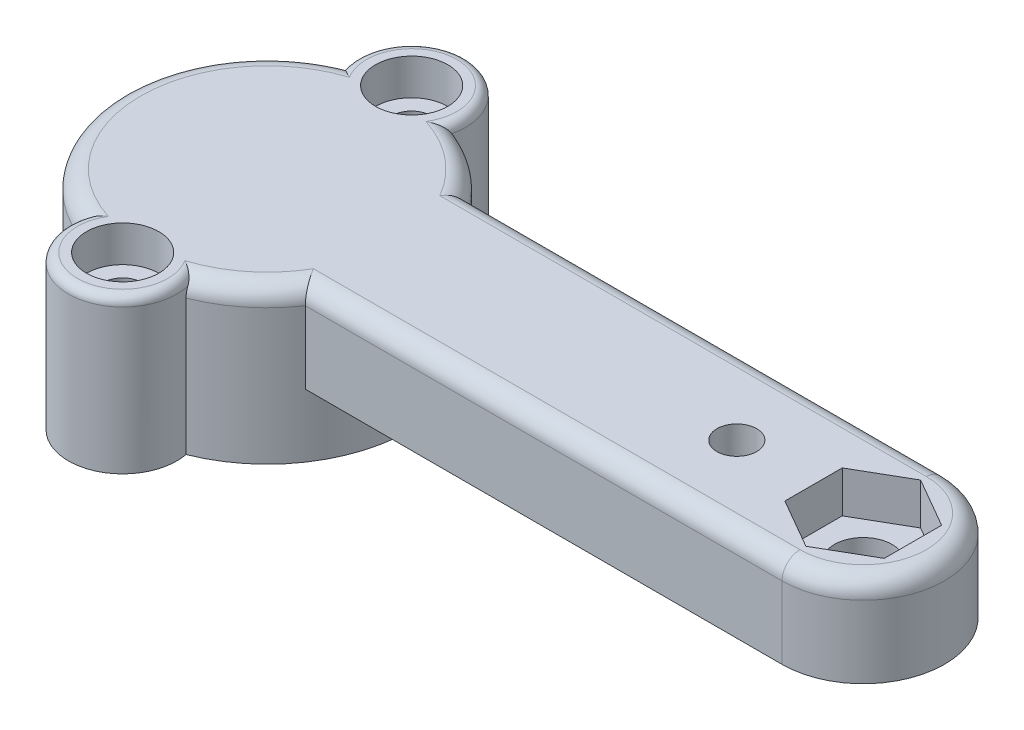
ISO-10303-21;
HEADER;
FILE_DESCRIPTION(('STEP AP214'),'2;1');
FILE_NAME('part.step','',(''),(''),'','','');
FILE_SCHEMA(('AUTOMOTIVE_DESIGN { 1 0 10303 214 1 1 1 1 }'));
ENDSEC;
DATA;
#1=APPLICATION_CONTEXT('core data for automotive mechanical design processes');
#2=APPLICATION_PROTOCOL_DEFINITION('international standard','automotive_design',2000,#1);
#3=PRODUCT_CONTEXT('',#1,'mechanical');
#4=PRODUCT('Part','Part','',(#3));
#5=PRODUCT_RELATED_PRODUCT_CATEGORY('part','',(#4));
#6=PRODUCT_DEFINITION_FORMATION('','',#4);
#7=PRODUCT_DEFINITION_CONTEXT('part definition',#1,'design');
#8=PRODUCT_DEFINITION('design','',#6,#7);
#9=PRODUCT_DEFINITION_SHAPE('','',#8);
#10=(LENGTH_UNIT() NAMED_UNIT(*) SI_UNIT(.MILLI.,.METRE.));
#11=(NAMED_UNIT(*) PLANE_ANGLE_UNIT() SI_UNIT($,.RADIAN.));
#12=(NAMED_UNIT(*) SI_UNIT($,.STERADIAN.) SOLID_ANGLE_UNIT());
#13=UNCERTAINTY_MEASURE_WITH_UNIT(LENGTH_MEASURE(1.E-05),#10,'distance_accuracy_value','');
#14=(GEOMETRIC_REPRESENTATION_CONTEXT(3) GLOBAL_UNCERTAINTY_ASSIGNED_CONTEXT((#13)) GLOBAL_UNIT_ASSIGNED_CONTEXT((#10,
#11,#12)) REPRESENTATION_CONTEXT('',''));
#15=CARTESIAN_POINT('',(0.,0.,0.));
#16=DIRECTION('',(0.,0.,1.));
#17=DIRECTION('',(1.,0.,0.));
#18=AXIS2_PLACEMENT_3D('',#15,#16,#17);
#19=CARTESIAN_POINT('',(-73.1998646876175,5.,-42.5));
#20=DIRECTION('',(0.,-1.,0.));
#21=DIRECTION('',(0.,0.,-1.));
#22=AXIS2_PLACEMENT_3D('',#19,#20,#21);
#23=CYLINDRICAL_SURFACE('',#22,1.1);
#24=CARTESIAN_POINT('',(-73.1998646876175,-3.5,-42.5));
#25=DIRECTION('',(0.,1.,0.));
#26=DIRECTION('',(0.,0.,1.));
#27=AXIS2_PLACEMENT_3D('',#24,#25,#26);
#28=CIRCLE('',#27,1.1);
#29=CARTESIAN_POINT('',(-73.1998646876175,-3.5,-41.4));
#30=VERTEX_POINT('',#29);
#31=EDGE_CURVE('E215',#30,#30,#28,.T.);
#32=ORIENTED_EDGE('',*,*,#31,.F.);
#33=EDGE_LOOP('',(#32));
#34=FACE_BOUND('',#33,.T.);
#35=CARTESIAN_POINT('',(-73.1998646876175,3.,-42.5));
#36=DIRECTION('',(0.,1.,0.));
#37=DIRECTION('',(0.,0.,1.));
#38=AXIS2_PLACEMENT_3D('',#35,#36,#37);
#39=CIRCLE('',#38,1.1);
#40=CARTESIAN_POINT('',(-73.1998646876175,3.,-41.4));
#41=VERTEX_POINT('',#40);
#42=EDGE_CURVE('E222',#41,#41,#39,.T.);
#43=ORIENTED_EDGE('',*,*,#42,.T.);
#44=EDGE_LOOP('',(#43));
#45=FACE_BOUND('',#44,.T.);
#46=ADVANCED_FACE('F37',(#34,#45),#23,.F.);
#47=CARTESIAN_POINT('',(-73.1998646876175,5.,-26.5));
#48=DIRECTION('',(0.,-1.,0.));
#49=DIRECTION('',(0.,0.,-1.));
#50=AXIS2_PLACEMENT_3D('',#47,#48,#49);
#51=CYLINDRICAL_SURFACE('',#50,1.10000000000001);
#52=CARTESIAN_POINT('',(-73.1998646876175,-3.5,-26.5));
#53=DIRECTION('',(0.,1.,0.));
#54=DIRECTION('',(0.,0.,1.));
#55=AXIS2_PLACEMENT_3D('',#52,#53,#54);
#56=CIRCLE('',#55,1.10000000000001);
#57=CARTESIAN_POINT('',(-73.1998646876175,-3.5,-25.4));
#58=VERTEX_POINT('',#57);
#59=EDGE_CURVE('E212',#58,#58,#56,.T.);
#60=ORIENTED_EDGE('',*,*,#59,.F.);
#61=EDGE_LOOP('',(#60));
#62=FACE_BOUND('',#61,.T.);
#63=CARTESIAN_POINT('',(-73.1998646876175,3.,-26.5));
#64=DIRECTION('',(0.,1.,0.));
#65=DIRECTION('',(0.,0.,1.));
#66=AXIS2_PLACEMENT_3D('',#63,#64,#65);
#67=CIRCLE('',#66,1.10000000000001);
#68=CARTESIAN_POINT('',(-73.1998646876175,3.,-25.4));
#69=VERTEX_POINT('',#68);
#70=EDGE_CURVE('E228',#69,#69,#67,.T.);
#71=ORIENTED_EDGE('',*,*,#70,.T.);
#72=EDGE_LOOP('',(#71));
#73=FACE_BOUND('',#72,.T.);
#74=ADVANCED_FACE('F400',(#62,#73),#51,.F.);
#75=CARTESIAN_POINT('',(-47.1998646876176,5.,-34.5));
#76=DIRECTION('',(0.,-1.,0.));
#77=DIRECTION('',(0.,0.,-1.));
#78=AXIS2_PLACEMENT_3D('',#75,#76,#77);
#79=CYLINDRICAL_SURFACE('',#78,1.1);
#80=CARTESIAN_POINT('',(-47.1998646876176,5.,-34.5));
#81=DIRECTION('',(0.,1.,0.));
#82=DIRECTION('',(0.,0.,1.));
#83=AXIS2_PLACEMENT_3D('',#80,#81,#82);
#84=CIRCLE('',#83,1.1);
#85=CARTESIAN_POINT('',(-47.1998646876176,5.,-33.4));
#86=VERTEX_POINT('',#85);
#87=EDGE_CURVE('E294',#86,#86,#84,.T.);
#88=ORIENTED_EDGE('',*,*,#87,.T.);
#89=EDGE_LOOP('',(#88));
#90=FACE_BOUND('',#89,.T.);
#91=CARTESIAN_POINT('',(-47.1998646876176,2.,-34.5));
#92=DIRECTION('',(0.,-1.,0.));
#93=DIRECTION('',(0.,0.,-1.));
#94=AXIS2_PLACEMENT_3D('',#91,#92,#93);
#95=CIRCLE('',#94,1.1);
#96=CARTESIAN_POINT('',(-47.1998646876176,2.,-35.6));
#97=VERTEX_POINT('',#96);
#98=EDGE_CURVE('E235',#97,#97,#95,.T.);
#99=ORIENTED_EDGE('',*,*,#98,.T.);
#100=EDGE_LOOP('',(#99));
#101=FACE_BOUND('',#100,.T.);
#102=ADVANCED_FACE('F406',(#90,#101),#79,.F.);
#103=CARTESIAN_POINT('',(-73.1998646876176,0.,-34.5));
#104=DIRECTION('',(0.,1.,0.));
#105=DIRECTION('',(0.,0.,1.));
#106=AXIS2_PLACEMENT_3D('',#103,#104,#105);
#107=PLANE('',#106);
#108=CARTESIAN_POINT('',(-47.1998646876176,0.,-34.5));
#109=DIRECTION('',(0.,-1.,0.));
#110=DIRECTION('',(0.,0.,-1.));
#111=AXIS2_PLACEMENT_3D('',#108,#109,#110);
#112=CIRCLE('',#111,2.2);
#113=CARTESIAN_POINT('',(-47.1998646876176,0.,-36.7));
#114=VERTEX_POINT('',#113);
#115=EDGE_CURVE('E236',#114,#114,#112,.T.);
#116=ORIENTED_EDGE('',*,*,#115,.F.);
#117=EDGE_LOOP('',(#116));
#118=FACE_BOUND('',#117,.T.);
#119=CARTESIAN_POINT('',(-40.1998646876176,0.,-34.5));
#120=DIRECTION('',(0.,1.,0.));
#121=DIRECTION('',(0.,0.,1.));
#122=AXIS2_PLACEMENT_3D('',#119,#120,#121);
#123=CIRCLE('',#122,1.59999999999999);
#124=CARTESIAN_POINT('',(-40.1998646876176,0.,-32.9));
#125=VERTEX_POINT('',#124);
#126=EDGE_CURVE('E297',#125,#125,#123,.T.);
#127=ORIENTED_EDGE('',*,*,#126,.T.);
#128=EDGE_LOOP('',(#127));
#129=FACE_BOUND('',#128,.T.);
#130=CARTESIAN_POINT('',(-73.1998646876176,0.,-34.5));
#131=DIRECTION('',(0.,-1.,0.));
#132=DIRECTION('',(0.,0.,-1.));
#133=AXIS2_PLACEMENT_3D('',#130,#131,#132);
#134=CIRCLE('',#133,8.00000000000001);
#135=CARTESIAN_POINT('',(-66.5854864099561,0.,-39.));
#136=VERTEX_POINT('',#135);
#137=CARTESIAN_POINT('',(-66.5854864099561,0.,-30.));
#138=VERTEX_POINT('',#137);
#139=EDGE_CURVE('E315',#136,#138,#134,.T.);
#140=ORIENTED_EDGE('',*,*,#139,.F.);
#141=DIRECTION('',(-1.,0.,0.));
#142=VECTOR('',#141,1.);
#143=CARTESIAN_POINT('',(-40.1998646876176,0.,-39.));
#144=LINE('',#143,#142);
#145=CARTESIAN_POINT('',(-40.1998646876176,0.,-39.));
#146=VERTEX_POINT('',#145);
#147=EDGE_CURVE('E304',#146,#136,#144,.T.);
#148=ORIENTED_EDGE('',*,*,#147,.F.);
#149=CARTESIAN_POINT('',(-40.1998646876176,0.,-34.5));
#150=DIRECTION('',(0.,1.,0.));
#151=DIRECTION('',(0.,0.,1.));
#152=AXIS2_PLACEMENT_3D('',#149,#150,#151);
#153=CIRCLE('',#152,4.5);
#154=CARTESIAN_POINT('',(-40.1998646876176,0.,-30.));
#155=VERTEX_POINT('',#154);
#156=EDGE_CURVE('E301',#155,#146,#153,.T.);
#157=ORIENTED_EDGE('',*,*,#156,.F.);
#158=DIRECTION('',(1.,0.,0.));
#159=VECTOR('',#158,1.);
#160=CARTESIAN_POINT('',(-40.1998646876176,0.,-30.));
#161=LINE('',#160,#159);
#162=EDGE_CURVE('E300',#138,#155,#161,.T.);
#163=ORIENTED_EDGE('',*,*,#162,.F.);
#164=EDGE_LOOP('',(#140,#148,#157,#163));
#165=FACE_BOUND('',#164,.T.);
#166=ADVANCED_FACE('F417',(#118,#129,#165),#107,.F.);
#167=CARTESIAN_POINT('',(-40.1998646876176,5.,-34.5));
#168=DIRECTION('',(0.,-1.,0.));
#169=DIRECTION('',(0.,0.,-1.));
#170=AXIS2_PLACEMENT_3D('',#167,#168,#169);
#171=CYLINDRICAL_SURFACE('',#170,1.59999999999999);
#172=ORIENTED_EDGE('',*,*,#126,.F.);
#173=EDGE_LOOP('',(#172));
#174=FACE_BOUND('',#173,.T.);
#175=CARTESIAN_POINT('',(-40.1998646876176,2.7,-34.5));
#176=DIRECTION('',(0.,1.,0.));
#177=DIRECTION('',(0.,0.,1.));
#178=AXIS2_PLACEMENT_3D('',#175,#176,#177);
#179=CIRCLE('',#178,1.59999999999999);
#180=CARTESIAN_POINT('',(-40.1998646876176,2.7,-32.9));
#181=VERTEX_POINT('',#180);
#182=EDGE_CURVE('E283',#181,#181,#179,.T.);
#183=ORIENTED_EDGE('',*,*,#182,.T.);
#184=EDGE_LOOP('',(#183));
#185=FACE_BOUND('',#184,.T.);
#186=ADVANCED_FACE('F419',(#174,#185),#171,.F.);
#187=CARTESIAN_POINT('',(-73.1998646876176,5.,-34.5));
#188=DIRECTION('',(0.,1.,0.));
#189=DIRECTION('',(0.,0.,1.));
#190=AXIS2_PLACEMENT_3D('',#187,#188,#189);
#191=PLANE('',#190);
#192=CARTESIAN_POINT('',(-73.1998646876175,5.,-42.5));
#193=DIRECTION('',(0.,1.,0.));
#194=DIRECTION('',(0.,0.,1.));
#195=AXIS2_PLACEMENT_3D('',#192,#193,#194);
#196=CIRCLE('',#195,2.);
#197=CARTESIAN_POINT('',(-73.1998646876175,5.,-40.5));
#198=VERTEX_POINT('',#197);
#199=EDGE_CURVE('E218',#198,#198,#196,.T.);
#200=ORIENTED_EDGE('',*,*,#199,.F.);
#201=EDGE_LOOP('',(#200));
#202=FACE_BOUND('',#201,.T.);
#203=CARTESIAN_POINT('',(-73.1998646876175,5.,-26.5));
#204=DIRECTION('',(0.,1.,0.));
#205=DIRECTION('',(0.,0.,1.));
#206=AXIS2_PLACEMENT_3D('',#203,#204,#205);
#207=CIRCLE('',#206,2.);
#208=CARTESIAN_POINT('',(-73.1998646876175,5.,-24.5));
#209=VERTEX_POINT('',#208);
#210=EDGE_CURVE('E229',#209,#209,#207,.T.);
#211=ORIENTED_EDGE('',*,*,#210,.F.);
#212=EDGE_LOOP('',(#211));
#213=FACE_BOUND('',#212,.T.);
#214=DIRECTION('',(0.866025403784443,0.,0.499999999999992));
#215=VECTOR('',#214,1.);
#216=CARTESIAN_POINT('',(-42.9498646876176,5.,-32.9122867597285));
#217=LINE('',#216,#215);
#218=CARTESIAN_POINT('',(-42.9498646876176,5.,-32.9122867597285));
#219=VERTEX_POINT('',#218);
#220=CARTESIAN_POINT('',(-40.1998646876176,5.,-31.324573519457));
#221=VERTEX_POINT('',#220);
#222=EDGE_CURVE('E245',#219,#221,#217,.T.);
#223=ORIENTED_EDGE('',*,*,#222,.F.);
#224=DIRECTION('',(0.,0.,1.));
#225=VECTOR('',#224,1.);
#226=CARTESIAN_POINT('',(-42.9498646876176,5.,-36.0877132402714));
#227=LINE('',#226,#225);
#228=CARTESIAN_POINT('',(-42.9498646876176,5.,-36.0877132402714));
#229=VERTEX_POINT('',#228);
#230=EDGE_CURVE('E250',#229,#219,#227,.T.);
#231=ORIENTED_EDGE('',*,*,#230,.F.);
#232=DIRECTION('',(-0.866025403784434,0.,0.500000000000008));
#233=VECTOR('',#232,1.);
#234=CARTESIAN_POINT('',(-40.1998646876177,5.,-37.6754264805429));
#235=LINE('',#234,#233);
#236=CARTESIAN_POINT('',(-40.1998646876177,5.,-37.6754264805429));
#237=VERTEX_POINT('',#236);
#238=EDGE_CURVE('E276',#237,#229,#235,.T.);
#239=ORIENTED_EDGE('',*,*,#238,.F.);
#240=DIRECTION('',(-0.866025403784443,0.,-0.499999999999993));
#241=VECTOR('',#240,1.);
#242=CARTESIAN_POINT('',(-37.4498646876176,5.,-36.0877132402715));
#243=LINE('',#242,#241);
#244=CARTESIAN_POINT('',(-37.4498646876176,5.,-36.0877132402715));
#245=VERTEX_POINT('',#244);
#246=EDGE_CURVE('E273',#245,#237,#243,.T.);
#247=ORIENTED_EDGE('',*,*,#246,.F.);
#248=DIRECTION('',(0.,0.,-1.));
#249=VECTOR('',#248,1.);
#250=CARTESIAN_POINT('',(-37.4498646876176,5.,-32.9122867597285));
#251=LINE('',#250,#249);
#252=CARTESIAN_POINT('',(-37.4498646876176,5.,-32.9122867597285));
#253=VERTEX_POINT('',#252);
#254=EDGE_CURVE('E270',#253,#245,#251,.T.);
#255=ORIENTED_EDGE('',*,*,#254,.F.);
#256=DIRECTION('',(0.866025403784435,0.,-0.500000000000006));
#257=VECTOR('',#256,1.);
#258=CARTESIAN_POINT('',(-40.1998646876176,5.,-31.324573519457));
#259=LINE('',#258,#257);
#260=EDGE_CURVE('E267',#221,#253,#259,.T.);
#261=ORIENTED_EDGE('',*,*,#260,.F.);
#262=EDGE_LOOP('',(#223,#231,#239,#247,#255,#261));
#263=FACE_BOUND('',#262,.T.);
#264=CARTESIAN_POINT('',(-73.1998646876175,5.,-26.5));
#265=DIRECTION('',(0.,1.,0.));
#266=DIRECTION('',(0.,0.,1.));
#267=AXIS2_PLACEMENT_3D('',#264,#265,#266);
#268=CIRCLE('',#267,2.50000000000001);
#269=CARTESIAN_POINT('',(-75.3179024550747,5.,-27.828125));
#270=VERTEX_POINT('',#269);
#271=CARTESIAN_POINT('',(-71.0818269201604,5.,-27.828125));
#272=VERTEX_POINT('',#271);
#273=EDGE_CURVE('E535',#270,#272,#268,.T.);
#274=ORIENTED_EDGE('',*,*,#273,.T.);
#275=CARTESIAN_POINT('',(-73.1998646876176,5.,-34.5));
#276=DIRECTION('',(0.,1.,0.));
#277=DIRECTION('',(0.,0.,1.));
#278=AXIS2_PLACEMENT_3D('',#275,#276,#277);
#279=CIRCLE('',#278,7.00000000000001);
#280=CARTESIAN_POINT('',(-67.1376868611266,5.,-31.));
#281=VERTEX_POINT('',#280);
#282=EDGE_CURVE('E515',#272,#281,#279,.T.);
#283=ORIENTED_EDGE('',*,*,#282,.T.);
#284=DIRECTION('',(1.,0.,0.));
#285=VECTOR('',#284,1.);
#286=CARTESIAN_POINT('',(-40.1998646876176,5.,-31.));
#287=LINE('',#286,#285);
#288=CARTESIAN_POINT('',(-40.1998646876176,5.,-31.));
#289=VERTEX_POINT('',#288);
#290=EDGE_CURVE('E509',#281,#289,#287,.T.);
#291=ORIENTED_EDGE('',*,*,#290,.T.);
#292=CARTESIAN_POINT('',(-40.1998646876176,5.,-34.5));
#293=DIRECTION('',(0.,1.,0.));
#294=DIRECTION('',(0.,0.,1.));
#295=AXIS2_PLACEMENT_3D('',#292,#293,#294);
#296=CIRCLE('',#295,3.5);
#297=CARTESIAN_POINT('',(-40.1998646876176,5.,-38.));
#298=VERTEX_POINT('',#297);
#299=EDGE_CURVE('E495',#289,#298,#296,.T.);
#300=ORIENTED_EDGE('',*,*,#299,.T.);
#301=DIRECTION('',(-1.,0.,0.));
#302=VECTOR('',#301,1.);
#303=CARTESIAN_POINT('',(-66.5854864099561,5.,-38.));
#304=LINE('',#303,#302);
#305=CARTESIAN_POINT('',(-67.1376868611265,5.,-38.));
#306=VERTEX_POINT('',#305);
#307=EDGE_CURVE('E504',#298,#306,#304,.T.);
#308=ORIENTED_EDGE('',*,*,#307,.T.);
#309=CARTESIAN_POINT('',(-73.1998646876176,5.,-34.5));
#310=DIRECTION('',(0.,1.,0.));
#311=DIRECTION('',(0.,0.,1.));
#312=AXIS2_PLACEMENT_3D('',#309,#310,#311);
#313=CIRCLE('',#312,7.00000000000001);
#314=CARTESIAN_POINT('',(-71.0818269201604,5.,-41.171875));
#315=VERTEX_POINT('',#314);
#316=EDGE_CURVE('E507',#306,#315,#313,.T.);
#317=ORIENTED_EDGE('',*,*,#316,.T.);
#318=CARTESIAN_POINT('',(-73.1998646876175,5.,-42.5));
#319=DIRECTION('',(0.,1.,0.));
#320=DIRECTION('',(0.,0.,1.));
#321=AXIS2_PLACEMENT_3D('',#318,#319,#320);
#322=CIRCLE('',#321,2.50000000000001);
#323=CARTESIAN_POINT('',(-75.3179024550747,5.,-41.171875));
#324=VERTEX_POINT('',#323);
#325=EDGE_CURVE('E465',#315,#324,#322,.T.);
#326=ORIENTED_EDGE('',*,*,#325,.T.);
#327=CARTESIAN_POINT('',(-73.1998646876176,5.,-34.5));
#328=DIRECTION('',(0.,1.,0.));
#329=DIRECTION('',(0.,0.,1.));
#330=AXIS2_PLACEMENT_3D('',#327,#328,#329);
#331=CIRCLE('',#330,7.00000000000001);
#332=EDGE_CURVE('E322',#324,#270,#331,.T.);
#333=ORIENTED_EDGE('',*,*,#332,.T.);
#334=EDGE_LOOP('',(#274,#283,#291,#300,#308,#317,#326,#333));
#335=FACE_BOUND('',#334,.T.);
#336=ORIENTED_EDGE('',*,*,#87,.F.);
#337=EDGE_LOOP('',(#336));
#338=FACE_BOUND('',#337,.T.);
#339=ADVANCED_FACE('F422',(#202,#213,#263,#335,#338),#191,.T.);
#340=CARTESIAN_POINT('',(-73.1998646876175,5.,-42.5));
#341=DIRECTION('',(0.,-1.,0.));
#342=DIRECTION('',(0.,0.,-1.));
#343=AXIS2_PLACEMENT_3D('',#340,#341,#342);
#344=CYLINDRICAL_SURFACE('',#343,3.00000000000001);
#345=CARTESIAN_POINT('',(-76.1466584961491,4.,-41.9375));
#346=CARTESIAN_POINT('',(-76.1466563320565,4.02792464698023,-41.9375009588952));
#347=CARTESIAN_POINT('',(-76.146435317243,4.05583559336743,-41.9363294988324));
#348=CARTESIAN_POINT('',(-76.1455398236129,4.1114515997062,-41.9316635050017));
#349=CARTESIAN_POINT('',(-76.1448654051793,4.13915668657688,-41.9281692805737));
#350=CARTESIAN_POINT('',(-76.1421428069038,4.22157091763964,-41.9142575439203));
#351=CARTESIAN_POINT('',(-76.1393954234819,4.27571851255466,-41.9004107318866));
#352=CARTESIAN_POINT('',(-76.1317589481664,4.38086381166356,-41.8641263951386));
#353=CARTESIAN_POINT('',(-76.126869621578,4.43186116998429,-41.8416879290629));
#354=CARTESIAN_POINT('',(-76.1145350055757,4.52937077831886,-41.7890676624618));
#355=CARTESIAN_POINT('',(-76.1070892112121,4.57588213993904,-41.7588843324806));
#356=CARTESIAN_POINT('',(-76.0890702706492,4.66365968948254,-41.6914711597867));
#357=CARTESIAN_POINT('',(-76.078462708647,4.70486060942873,-41.6541654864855));
#358=CARTESIAN_POINT('',(-76.0536955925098,4.78024537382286,-41.5740392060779));
#359=CARTESIAN_POINT('',(-76.0395361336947,4.81442940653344,-41.5312187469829));
#360=CARTESIAN_POINT('',(-76.0074555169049,4.87457107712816,-41.4418552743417));
#361=CARTESIAN_POINT('',(-75.9895598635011,4.90058163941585,-41.3953387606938));
#362=CARTESIAN_POINT('',(-75.9498809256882,4.94387828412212,-41.2999709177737));
#363=CARTESIAN_POINT('',(-75.9281001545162,4.96116997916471,-41.2511211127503));
#364=CARTESIAN_POINT('',(-75.8883251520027,4.98257287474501,-41.1682404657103));
#365=CARTESIAN_POINT('',(-75.8712810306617,4.98911586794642,-41.1343593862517));
#366=CARTESIAN_POINT('',(-75.8356927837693,4.99783300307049,-41.066862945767));
#367=CARTESIAN_POINT('',(-75.8171500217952,5.00001107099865,-41.0332473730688));
#368=CARTESIAN_POINT('',(-75.7979408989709,5.,-41.));
#369=B_SPLINE_CURVE_WITH_KNOTS('',3,(#345,#346,#347,#348,#349,#350,#351,#352,#353,#354,#355,
#356,#357,#358,#359,#360,#361,#362,#363,#364,#365,#366,#367,#368),.UNSPECIFIED.,.F.,.F.,(4,2,2,
2,2,2,2,2,2,2,2,4),(0.,0.0837214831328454,0.167431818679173,0.334439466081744,0.501465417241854,
0.668524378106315,0.837472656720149,1.00641640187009,1.17424252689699,1.34196047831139,
1.4571579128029,1.57225168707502),.UNSPECIFIED.);
#370=CARTESIAN_POINT('',(-76.1466584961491,4.,-41.9375));
#371=VERTEX_POINT('',#370);
#372=CARTESIAN_POINT('',(-76.1181663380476,4.50000000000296,-41.8046472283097));
#373=VERTEX_POINT('',#372);
#374=EDGE_CURVE('E460',#371,#373,#369,.T.);
#375=ORIENTED_EDGE('',*,*,#374,.T.);
#376=CARTESIAN_POINT('',(-73.1998646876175,4.5,-42.5));
#377=DIRECTION('',(0.,1.,0.));
#378=DIRECTION('',(0.,0.,1.));
#379=AXIS2_PLACEMENT_3D('',#376,#377,#378);
#380=CIRCLE('',#379,3.00000000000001);
#381=CARTESIAN_POINT('',(-70.2815630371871,4.5,-41.8046472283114));
#382=VERTEX_POINT('',#381);
#383=EDGE_CURVE('E57',#373,#382,#380,.F.);
#384=ORIENTED_EDGE('',*,*,#383,.T.);
#385=CARTESIAN_POINT('',(-70.6017884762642,5.,-41.));
#386=CARTESIAN_POINT('',(-70.5882845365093,5.00000058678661,-41.0233858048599));
#387=CARTESIAN_POINT('',(-70.575105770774,4.99892761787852,-41.0469459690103));
#388=CARTESIAN_POINT('',(-70.5494662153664,4.9946254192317,-41.0942580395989));
#389=CARTESIAN_POINT('',(-70.5370054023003,4.99139625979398,-41.1180099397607));
#390=CARTESIAN_POINT('',(-70.5008676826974,4.97848483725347,-41.1891868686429));
#391=CARTESIAN_POINT('',(-70.4783590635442,4.96557870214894,-41.2366659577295));
#392=CARTESIAN_POINT('',(-70.4368790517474,4.93145107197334,-41.3301559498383));
#393=CARTESIAN_POINT('',(-70.4179096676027,4.91022487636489,-41.3761660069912));
#394=CARTESIAN_POINT('',(-70.3835687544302,4.86005050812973,-41.4652265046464));
#395=CARTESIAN_POINT('',(-70.3681976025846,4.83110152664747,-41.5082766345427));
#396=CARTESIAN_POINT('',(-70.3407329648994,4.76594284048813,-41.5904582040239));
#397=CARTESIAN_POINT('',(-70.3286758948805,4.72965952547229,-41.6295433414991));
#398=CARTESIAN_POINT('',(-70.307695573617,4.65098989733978,-41.7020125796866));
#399=CARTESIAN_POINT('',(-70.2987733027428,4.60860168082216,-41.7353948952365));
#400=CARTESIAN_POINT('',(-70.283395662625,4.51741171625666,-41.7962754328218));
#401=CARTESIAN_POINT('',(-70.2770259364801,4.46845114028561,-41.8235576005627));
#402=CARTESIAN_POINT('',(-70.2666980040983,4.36653808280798,-41.869843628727));
#403=CARTESIAN_POINT('',(-70.262738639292,4.31358753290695,-41.8888514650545));
#404=CARTESIAN_POINT('',(-70.2575039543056,4.21717494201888,-41.9146357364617));
#405=CARTESIAN_POINT('',(-70.2558289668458,4.17420020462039,-41.9231864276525));
#406=CARTESIAN_POINT('',(-70.2536191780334,4.08749068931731,-41.9346283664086));
#407=CARTESIAN_POINT('',(-70.253084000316,4.04375616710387,-41.9375214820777));
#408=CARTESIAN_POINT('',(-70.2530708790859,4.,-41.9375));
#409=B_SPLINE_CURVE_WITH_KNOTS('',3,(#385,#386,#387,#388,#389,#390,#391,#392,#393,#394,#395,
#396,#397,#398,#399,#400,#401,#402,#403,#404,#405,#406,#407,#408),.UNSPECIFIED.,.F.,.F.,(4,2,2,
2,2,2,2,2,2,2,2,4),(0.,0.0809663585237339,0.161930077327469,0.323403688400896,0.484968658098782,
0.64655055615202,0.809842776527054,0.973186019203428,1.14162505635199,1.30998306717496,
1.44115688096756,1.57228737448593),.UNSPECIFIED.);
#410=CARTESIAN_POINT('',(-70.2530708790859,4.,-41.9375));
#411=VERTEX_POINT('',#410);
#412=EDGE_CURVE('E345',#382,#411,#409,.T.);
#413=ORIENTED_EDGE('',*,*,#412,.T.);
#414=DIRECTION('',(0.,-1.,0.));
#415=VECTOR('',#414,1.);
#416=CARTESIAN_POINT('',(-70.2530708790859,5.,-41.9375));
#417=LINE('',#416,#415);
#418=CARTESIAN_POINT('',(-70.2530708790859,-3.5,-41.9375));
#419=VERTEX_POINT('',#418);
#420=EDGE_CURVE('E313',#411,#419,#417,.T.);
#421=ORIENTED_EDGE('',*,*,#420,.T.);
#422=CARTESIAN_POINT('',(-73.1998646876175,-3.5,-42.5));
#423=DIRECTION('',(0.,1.,0.));
#424=DIRECTION('',(0.,0.,1.));
#425=AXIS2_PLACEMENT_3D('',#422,#423,#424);
#426=CIRCLE('',#425,3.00000000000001);
#427=CARTESIAN_POINT('',(-76.1466584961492,-3.5,-41.9375));
#428=VERTEX_POINT('',#427);
#429=EDGE_CURVE('E202',#419,#428,#426,.T.);
#430=ORIENTED_EDGE('',*,*,#429,.T.);
#431=DIRECTION('',(0.,-1.,0.));
#432=VECTOR('',#431,1.);
#433=CARTESIAN_POINT('',(-76.1466584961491,5.,-41.9375));
#434=LINE('',#433,#432);
#435=EDGE_CURVE('E311',#371,#428,#434,.T.);
#436=ORIENTED_EDGE('',*,*,#435,.F.);
#437=EDGE_LOOP('',(#375,#384,#413,#421,#430,#436));
#438=FACE_BOUND('',#437,.T.);
#439=ADVANCED_FACE('F426',(#438),#344,.T.);
#440=CARTESIAN_POINT('',(-73.1998646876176,5.,-34.5));
#441=DIRECTION('',(0.,-1.,0.));
#442=DIRECTION('',(0.,0.,-1.));
#443=AXIS2_PLACEMENT_3D('',#440,#441,#442);
#444=CYLINDRICAL_SURFACE('',#443,8.00000000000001);
#445=DIRECTION('',(0.,-1.,0.));
#446=VECTOR('',#445,1.);
#447=CARTESIAN_POINT('',(-76.1466584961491,5.,-27.0625));
#448=LINE('',#447,#446);
#449=CARTESIAN_POINT('',(-76.1466584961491,4.,-27.0625));
#450=VERTEX_POINT('',#449);
#451=CARTESIAN_POINT('',(-76.1466584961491,-3.5,-27.0625));
#452=VERTEX_POINT('',#451);
#453=EDGE_CURVE('E191',#450,#452,#448,.T.);
#454=ORIENTED_EDGE('',*,*,#453,.F.);
#455=CARTESIAN_POINT('',(-73.1998646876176,4.,-34.5));
#456=DIRECTION('',(0.,1.,0.));
#457=DIRECTION('',(0.,0.,1.));
#458=AXIS2_PLACEMENT_3D('',#455,#456,#457);
#459=CIRCLE('',#458,8.00000000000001);
#460=EDGE_CURVE('E336',#450,#371,#459,.F.);
#461=ORIENTED_EDGE('',*,*,#460,.T.);
#462=ORIENTED_EDGE('',*,*,#435,.T.);
#463=CARTESIAN_POINT('',(-73.1998646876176,-3.5,-34.5));
#464=DIRECTION('',(0.,1.,0.));
#465=DIRECTION('',(0.,0.,1.));
#466=AXIS2_PLACEMENT_3D('',#463,#464,#465);
#467=CIRCLE('',#466,8.00000000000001);
#468=EDGE_CURVE('E207',#428,#452,#467,.T.);
#469=ORIENTED_EDGE('',*,*,#468,.T.);
#470=EDGE_LOOP('',(#454,#461,#462,#469));
#471=FACE_BOUND('',#470,.T.);
#472=ADVANCED_FACE('F446',(#471),#444,.T.);
#473=CARTESIAN_POINT('',(-73.1998646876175,5.,-26.5));
#474=DIRECTION('',(0.,-1.,0.));
#475=DIRECTION('',(0.,0.,-1.));
#476=AXIS2_PLACEMENT_3D('',#473,#474,#475);
#477=CYLINDRICAL_SURFACE('',#476,3.00000000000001);
#478=CARTESIAN_POINT('',(-70.2530708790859,4.,-27.0625));
#479=CARTESIAN_POINT('',(-70.2530730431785,4.02792464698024,-27.0624990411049));
#480=CARTESIAN_POINT('',(-70.253294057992,4.05583559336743,-27.0636705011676));
#481=CARTESIAN_POINT('',(-70.2541895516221,4.1114515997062,-27.0683364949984));
#482=CARTESIAN_POINT('',(-70.2548639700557,4.13915668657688,-27.0718307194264));
#483=CARTESIAN_POINT('',(-70.2575865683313,4.22157091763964,-27.0857424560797));
#484=CARTESIAN_POINT('',(-70.2603339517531,4.27571851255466,-27.0995892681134));
#485=CARTESIAN_POINT('',(-70.2679704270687,4.38086381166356,-27.1358736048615));
#486=CARTESIAN_POINT('',(-70.272859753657,4.43186116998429,-27.1583120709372));
#487=CARTESIAN_POINT('',(-70.2851943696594,4.52937077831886,-27.2109323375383));
#488=CARTESIAN_POINT('',(-70.292640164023,4.57588213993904,-27.2411156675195));
#489=CARTESIAN_POINT('',(-70.3106591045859,4.66365968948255,-27.3085288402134));
#490=CARTESIAN_POINT('',(-70.3212666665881,4.70486060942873,-27.3458345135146));
#491=CARTESIAN_POINT('',(-70.3460337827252,4.78024537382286,-27.4259607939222));
#492=CARTESIAN_POINT('',(-70.3601932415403,4.81442940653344,-27.4687812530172));
#493=CARTESIAN_POINT('',(-70.3922738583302,4.87457107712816,-27.5581447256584));
#494=CARTESIAN_POINT('',(-70.410169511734,4.90058163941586,-27.6046612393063));
#495=CARTESIAN_POINT('',(-70.4498484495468,4.94387828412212,-27.7000290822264));
#496=CARTESIAN_POINT('',(-70.4716292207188,4.96116997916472,-27.7488788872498));
#497=CARTESIAN_POINT('',(-70.5114042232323,4.98257287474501,-27.8317595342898));
#498=CARTESIAN_POINT('',(-70.5284483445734,4.98911586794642,-27.8656406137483));
#499=CARTESIAN_POINT('',(-70.5640365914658,4.99783300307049,-27.9331370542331));
#500=CARTESIAN_POINT('',(-70.5825793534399,5.00001107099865,-27.9667526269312));
#501=CARTESIAN_POINT('',(-70.6017884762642,5.,-28.));
#502=B_SPLINE_CURVE_WITH_KNOTS('',3,(#478,#479,#480,#481,#482,#483,#484,#485,#486,#487,#488,
#489,#490,#491,#492,#493,#494,#495,#496,#497,#498,#499,#500,#501),.UNSPECIFIED.,.F.,.F.,(4,2,2,
2,2,2,2,2,2,2,2,4),(0.,0.0837214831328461,0.167431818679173,0.334439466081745,0.501465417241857,
0.668524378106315,0.837472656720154,1.0064164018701,1.174242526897,1.3419604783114,
1.45715791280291,1.57225168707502),.UNSPECIFIED.);
#503=CARTESIAN_POINT('',(-70.2530708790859,4.,-27.0625));
#504=VERTEX_POINT('',#503);
#505=CARTESIAN_POINT('',(-70.2815630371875,4.50000000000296,-27.1953527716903));
#506=VERTEX_POINT('',#505);
#507=EDGE_CURVE('E338',#504,#506,#502,.T.);
#508=ORIENTED_EDGE('',*,*,#507,.T.);
#509=CARTESIAN_POINT('',(-73.1998646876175,4.5,-26.5));
#510=DIRECTION('',(0.,1.,0.));
#511=DIRECTION('',(0.,0.,1.));
#512=AXIS2_PLACEMENT_3D('',#509,#510,#511);
#513=CIRCLE('',#512,3.00000000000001);
#514=CARTESIAN_POINT('',(-76.118166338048,4.5,-27.1953527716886));
#515=VERTEX_POINT('',#514);
#516=EDGE_CURVE('E541',#506,#515,#513,.F.);
#517=ORIENTED_EDGE('',*,*,#516,.T.);
#518=CARTESIAN_POINT('',(-75.7979408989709,5.,-28.));
#519=CARTESIAN_POINT('',(-75.8114448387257,5.00000058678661,-27.97661419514));
#520=CARTESIAN_POINT('',(-75.8246236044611,4.99892761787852,-27.9530540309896));
#521=CARTESIAN_POINT('',(-75.8502631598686,4.9946254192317,-27.9057419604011));
#522=CARTESIAN_POINT('',(-75.8627239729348,4.99139625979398,-27.8819900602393));
#523=CARTESIAN_POINT('',(-75.8988616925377,4.97848483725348,-27.810813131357));
#524=CARTESIAN_POINT('',(-75.9213703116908,4.96557870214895,-27.7633340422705));
#525=CARTESIAN_POINT('',(-75.9628503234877,4.93145107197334,-27.6698440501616));
#526=CARTESIAN_POINT('',(-75.9818197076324,4.91022487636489,-27.6238339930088));
#527=CARTESIAN_POINT('',(-76.0161606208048,4.86005050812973,-27.5347734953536));
#528=CARTESIAN_POINT('',(-76.0315317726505,4.83110152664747,-27.4917233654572));
#529=CARTESIAN_POINT('',(-76.0589964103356,4.76594284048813,-27.409541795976));
#530=CARTESIAN_POINT('',(-76.0710534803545,4.7296595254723,-27.3704566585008));
#531=CARTESIAN_POINT('',(-76.092033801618,4.65098989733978,-27.2979874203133));
#532=CARTESIAN_POINT('',(-76.1009560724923,4.60860168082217,-27.2646051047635));
#533=CARTESIAN_POINT('',(-76.1163337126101,4.51741171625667,-27.2037245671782));
#534=CARTESIAN_POINT('',(-76.1227034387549,4.46845114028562,-27.1764423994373));
#535=CARTESIAN_POINT('',(-76.1330313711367,4.366538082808,-27.1301563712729));
#536=CARTESIAN_POINT('',(-76.1369907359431,4.31358753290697,-27.1111485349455));
#537=CARTESIAN_POINT('',(-76.1422254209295,4.21717494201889,-27.0853642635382));
#538=CARTESIAN_POINT('',(-76.1439004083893,4.1742002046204,-27.0768135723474));
#539=CARTESIAN_POINT('',(-76.1461101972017,4.08749068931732,-27.0653716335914));
#540=CARTESIAN_POINT('',(-76.1466453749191,4.04375616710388,-27.0624785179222));
#541=CARTESIAN_POINT('',(-76.1466584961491,4.,-27.0625));
#542=B_SPLINE_CURVE_WITH_KNOTS('',3,(#518,#519,#520,#521,#522,#523,#524,#525,#526,#527,#528,
#529,#530,#531,#532,#533,#534,#535,#536,#537,#538,#539,#540,#541),.UNSPECIFIED.,.F.,.F.,(4,2,2,
2,2,2,2,2,2,2,2,4),(0.,0.0809663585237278,0.16193007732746,0.323403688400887,0.484968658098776,
0.646550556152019,0.80984277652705,0.97318601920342,1.14162505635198,1.30998306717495,
1.44115688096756,1.57228737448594),.UNSPECIFIED.);
#543=EDGE_CURVE('E466',#515,#450,#542,.T.);
#544=ORIENTED_EDGE('',*,*,#543,.T.);
#545=ORIENTED_EDGE('',*,*,#453,.T.);
#546=CARTESIAN_POINT('',(-73.1998646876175,-3.5,-26.5));
#547=DIRECTION('',(0.,1.,0.));
#548=DIRECTION('',(0.,0.,1.));
#549=AXIS2_PLACEMENT_3D('',#546,#547,#548);
#550=CIRCLE('',#549,3.00000000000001);
#551=CARTESIAN_POINT('',(-70.253070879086,-3.5,-27.0625));
#552=VERTEX_POINT('',#551);
#553=EDGE_CURVE('E199',#452,#552,#550,.T.);
#554=ORIENTED_EDGE('',*,*,#553,.T.);
#555=DIRECTION('',(0.,-1.,0.));
#556=VECTOR('',#555,1.);
#557=CARTESIAN_POINT('',(-70.2530708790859,5.,-27.0625));
#558=LINE('',#557,#556);
#559=EDGE_CURVE('E179',#504,#552,#558,.T.);
#560=ORIENTED_EDGE('',*,*,#559,.F.);
#561=EDGE_LOOP('',(#508,#517,#544,#545,#554,#560));
#562=FACE_BOUND('',#561,.T.);
#563=ADVANCED_FACE('F205',(#562),#477,.T.);
#564=CARTESIAN_POINT('',(-73.1998646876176,5.,-34.5));
#565=DIRECTION('',(0.,-1.,0.));
#566=DIRECTION('',(0.,0.,-1.));
#567=AXIS2_PLACEMENT_3D('',#564,#565,#566);
#568=CYLINDRICAL_SURFACE('',#567,8.00000000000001);
#569=DIRECTION('',(0.,-1.,0.));
#570=VECTOR('',#569,1.);
#571=CARTESIAN_POINT('',(-66.5854864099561,5.,-30.));
#572=LINE('',#571,#570);
#573=CARTESIAN_POINT('',(-66.5854864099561,4.,-30.));
#574=VERTEX_POINT('',#573);
#575=EDGE_CURVE('E192',#574,#138,#572,.T.);
#576=ORIENTED_EDGE('',*,*,#575,.F.);
#577=CARTESIAN_POINT('',(-73.1998646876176,4.,-34.5));
#578=DIRECTION('',(0.,1.,0.));
#579=DIRECTION('',(0.,0.,1.));
#580=AXIS2_PLACEMENT_3D('',#577,#578,#579);
#581=CIRCLE('',#580,8.00000000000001);
#582=EDGE_CURVE('E186',#574,#504,#581,.F.);
#583=ORIENTED_EDGE('',*,*,#582,.T.);
#584=ORIENTED_EDGE('',*,*,#559,.T.);
#585=CARTESIAN_POINT('',(-73.1998646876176,-3.5,-34.5));
#586=DIRECTION('',(0.,1.,0.));
#587=DIRECTION('',(0.,0.,1.));
#588=AXIS2_PLACEMENT_3D('',#585,#586,#587);
#589=CIRCLE('',#588,8.00000000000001);
#590=EDGE_CURVE('E184',#552,#419,#589,.T.);
#591=ORIENTED_EDGE('',*,*,#590,.T.);
#592=ORIENTED_EDGE('',*,*,#420,.F.);
#593=CARTESIAN_POINT('',(-73.1998646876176,4.,-34.5));
#594=DIRECTION('',(0.,1.,0.));
#595=DIRECTION('',(0.,0.,1.));
#596=AXIS2_PLACEMENT_3D('',#593,#594,#595);
#597=CIRCLE('',#596,8.00000000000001);
#598=CARTESIAN_POINT('',(-66.5854864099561,4.,-39.));
#599=VERTEX_POINT('',#598);
#600=EDGE_CURVE('E333',#411,#599,#597,.F.);
#601=ORIENTED_EDGE('',*,*,#600,.T.);
#602=DIRECTION('',(0.,-1.,0.));
#603=VECTOR('',#602,1.);
#604=CARTESIAN_POINT('',(-66.5854864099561,5.,-39.));
#605=LINE('',#604,#603);
#606=EDGE_CURVE('E308',#599,#136,#605,.T.);
#607=ORIENTED_EDGE('',*,*,#606,.T.);
#608=ORIENTED_EDGE('',*,*,#139,.T.);
#609=EDGE_LOOP('',(#576,#583,#584,#591,#592,#601,#607,#608));
#610=FACE_BOUND('',#609,.T.);
#611=ADVANCED_FACE('F182',(#610),#568,.T.);
#612=CARTESIAN_POINT('',(-40.1998646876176,5.,-30.));
#613=DIRECTION('',(0.,0.,-1.));
#614=DIRECTION('',(-1.,0.,0.));
#615=AXIS2_PLACEMENT_3D('',#612,#613,#614);
#616=PLANE('',#615);
#617=DIRECTION('',(0.,-1.,0.));
#618=VECTOR('',#617,1.);
#619=CARTESIAN_POINT('',(-40.1998646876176,5.,-30.));
#620=LINE('',#619,#618);
#621=CARTESIAN_POINT('',(-40.1998646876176,4.,-30.));
#622=VERTEX_POINT('',#621);
#623=EDGE_CURVE('E307',#622,#155,#620,.T.);
#624=ORIENTED_EDGE('',*,*,#623,.F.);
#625=DIRECTION('',(1.,0.,0.));
#626=VECTOR('',#625,1.);
#627=CARTESIAN_POINT('',(-66.5854864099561,4.,-30.));
#628=LINE('',#627,#626);
#629=EDGE_CURVE('E331',#622,#574,#628,.F.);
#630=ORIENTED_EDGE('',*,*,#629,.T.);
#631=ORIENTED_EDGE('',*,*,#575,.T.);
#632=ORIENTED_EDGE('',*,*,#162,.T.);
#633=EDGE_LOOP('',(#624,#630,#631,#632));
#634=FACE_BOUND('',#633,.T.);
#635=ADVANCED_FACE('F438',(#634),#616,.F.);
#636=CARTESIAN_POINT('',(-40.1998646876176,5.,-34.5));
#637=DIRECTION('',(0.,-1.,0.));
#638=DIRECTION('',(0.,0.,-1.));
#639=AXIS2_PLACEMENT_3D('',#636,#637,#638);
#640=CYLINDRICAL_SURFACE('',#639,4.5);
#641=DIRECTION('',(0.,-1.,0.));
#642=VECTOR('',#641,1.);
#643=CARTESIAN_POINT('',(-40.1998646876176,5.,-39.));
#644=LINE('',#643,#642);
#645=CARTESIAN_POINT('',(-40.1998646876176,4.,-39.));
#646=VERTEX_POINT('',#645);
#647=EDGE_CURVE('E305',#646,#146,#644,.T.);
#648=ORIENTED_EDGE('',*,*,#647,.F.);
#649=CARTESIAN_POINT('',(-40.1998646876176,4.,-34.5));
#650=DIRECTION('',(0.,1.,0.));
#651=DIRECTION('',(0.,0.,1.));
#652=AXIS2_PLACEMENT_3D('',#649,#650,#651);
#653=CIRCLE('',#652,4.5);
#654=EDGE_CURVE('E329',#646,#622,#653,.F.);
#655=ORIENTED_EDGE('',*,*,#654,.T.);
#656=ORIENTED_EDGE('',*,*,#623,.T.);
#657=ORIENTED_EDGE('',*,*,#156,.T.);
#658=EDGE_LOOP('',(#648,#655,#656,#657));
#659=FACE_BOUND('',#658,.T.);
#660=ADVANCED_FACE('F434',(#659),#640,.T.);
#661=CARTESIAN_POINT('',(-40.1998646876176,5.,-39.));
#662=DIRECTION('',(0.,0.,1.));
#663=DIRECTION('',(1.,0.,0.));
#664=AXIS2_PLACEMENT_3D('',#661,#662,#663);
#665=PLANE('',#664);
#666=ORIENTED_EDGE('',*,*,#606,.F.);
#667=DIRECTION('',(-1.,0.,0.));
#668=VECTOR('',#667,1.);
#669=CARTESIAN_POINT('',(-40.1998646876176,4.,-39.));
#670=LINE('',#669,#668);
#671=EDGE_CURVE('E501',#599,#646,#670,.F.);
#672=ORIENTED_EDGE('',*,*,#671,.T.);
#673=ORIENTED_EDGE('',*,*,#647,.T.);
#674=ORIENTED_EDGE('',*,*,#147,.T.);
#675=EDGE_LOOP('',(#666,#672,#673,#674));
#676=FACE_BOUND('',#675,.T.);
#677=ADVANCED_FACE('F431',(#676),#665,.F.);
#678=CARTESIAN_POINT('',(-42.9498646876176,2.7,-32.9122867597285));
#679=DIRECTION('',(-0.499999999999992,0.,0.866025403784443));
#680=DIRECTION('',(0.866025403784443,0.,0.499999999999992));
#681=AXIS2_PLACEMENT_3D('',#678,#679,#680);
#682=PLANE('',#681);
#683=ORIENTED_EDGE('',*,*,#222,.T.);
#684=DIRECTION('',(0.,1.,0.));
#685=VECTOR('',#684,1.);
#686=CARTESIAN_POINT('',(-40.1998646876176,2.7,-31.324573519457));
#687=LINE('',#686,#685);
#688=CARTESIAN_POINT('',(-40.1998646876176,2.7,-31.324573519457));
#689=VERTEX_POINT('',#688);
#690=EDGE_CURVE('E265',#689,#221,#687,.T.);
#691=ORIENTED_EDGE('',*,*,#690,.F.);
#692=DIRECTION('',(0.866025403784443,0.,0.499999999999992));
#693=VECTOR('',#692,1.);
#694=CARTESIAN_POINT('',(-42.9498646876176,2.7,-32.9122867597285));
#695=LINE('',#694,#693);
#696=CARTESIAN_POINT('',(-42.9498646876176,2.7,-32.9122867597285));
#697=VERTEX_POINT('',#696);
#698=EDGE_CURVE('E246',#697,#689,#695,.T.);
#699=ORIENTED_EDGE('',*,*,#698,.F.);
#700=DIRECTION('',(0.,1.,0.));
#701=VECTOR('',#700,1.);
#702=CARTESIAN_POINT('',(-42.9498646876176,2.7,-32.9122867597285));
#703=LINE('',#702,#701);
#704=EDGE_CURVE('E281',#697,#219,#703,.T.);
#705=ORIENTED_EDGE('',*,*,#704,.T.);
#706=EDGE_LOOP('',(#683,#691,#699,#705));
#707=FACE_BOUND('',#706,.T.);
#708=ADVANCED_FACE('F412',(#707),#682,.F.);
#709=CARTESIAN_POINT('',(-42.9498646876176,2.7,-36.0877132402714));
#710=DIRECTION('',(-1.,0.,0.));
#711=DIRECTION('',(0.,0.,1.));
#712=AXIS2_PLACEMENT_3D('',#709,#710,#711);
#713=PLANE('',#712);
#714=ORIENTED_EDGE('',*,*,#230,.T.);
#715=ORIENTED_EDGE('',*,*,#704,.F.);
#716=DIRECTION('',(0.,0.,1.));
#717=VECTOR('',#716,1.);
#718=CARTESIAN_POINT('',(-42.9498646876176,2.7,-36.0877132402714));
#719=LINE('',#718,#717);
#720=CARTESIAN_POINT('',(-42.9498646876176,2.7,-36.0877132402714));
#721=VERTEX_POINT('',#720);
#722=EDGE_CURVE('E262',#721,#697,#719,.T.);
#723=ORIENTED_EDGE('',*,*,#722,.F.);
#724=DIRECTION('',(0.,1.,0.));
#725=VECTOR('',#724,1.);
#726=CARTESIAN_POINT('',(-42.9498646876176,2.7,-36.0877132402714));
#727=LINE('',#726,#725);
#728=EDGE_CURVE('E284',#721,#229,#727,.T.);
#729=ORIENTED_EDGE('',*,*,#728,.T.);
#730=EDGE_LOOP('',(#714,#715,#723,#729));
#731=FACE_BOUND('',#730,.T.);
#732=ADVANCED_FACE('F608',(#731),#713,.F.);
#733=CARTESIAN_POINT('',(-40.1998646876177,2.7,-37.6754264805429));
#734=DIRECTION('',(-0.500000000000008,0.,-0.866025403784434));
#735=DIRECTION('',(-0.866025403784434,0.,0.500000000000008));
#736=AXIS2_PLACEMENT_3D('',#733,#734,#735);
#737=PLANE('',#736);
#738=ORIENTED_EDGE('',*,*,#238,.T.);
#739=ORIENTED_EDGE('',*,*,#728,.F.);
#740=DIRECTION('',(-0.866025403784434,0.,0.500000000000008));
#741=VECTOR('',#740,1.);
#742=CARTESIAN_POINT('',(-40.1998646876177,2.7,-37.6754264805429));
#743=LINE('',#742,#741);
#744=CARTESIAN_POINT('',(-40.1998646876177,2.7,-37.6754264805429));
#745=VERTEX_POINT('',#744);
#746=EDGE_CURVE('E259',#745,#721,#743,.T.);
#747=ORIENTED_EDGE('',*,*,#746,.F.);
#748=DIRECTION('',(0.,1.,0.));
#749=VECTOR('',#748,1.);
#750=CARTESIAN_POINT('',(-40.1998646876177,2.7,-37.6754264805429));
#751=LINE('',#750,#749);
#752=EDGE_CURVE('E286',#745,#237,#751,.T.);
#753=ORIENTED_EDGE('',*,*,#752,.T.);
#754=EDGE_LOOP('',(#738,#739,#747,#753));
#755=FACE_BOUND('',#754,.T.);
#756=ADVANCED_FACE('F605',(#755),#737,.F.);
#757=CARTESIAN_POINT('',(-37.4498646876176,2.7,-36.0877132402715));
#758=DIRECTION('',(0.499999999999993,0.,-0.866025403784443));
#759=DIRECTION('',(-0.866025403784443,0.,-0.499999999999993));
#760=AXIS2_PLACEMENT_3D('',#757,#758,#759);
#761=PLANE('',#760);
#762=ORIENTED_EDGE('',*,*,#246,.T.);
#763=ORIENTED_EDGE('',*,*,#752,.F.);
#764=DIRECTION('',(-0.866025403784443,0.,-0.499999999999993));
#765=VECTOR('',#764,1.);
#766=CARTESIAN_POINT('',(-37.4498646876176,2.7,-36.0877132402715));
#767=LINE('',#766,#765);
#768=CARTESIAN_POINT('',(-37.4498646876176,2.7,-36.0877132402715));
#769=VERTEX_POINT('',#768);
#770=EDGE_CURVE('E256',#769,#745,#767,.T.);
#771=ORIENTED_EDGE('',*,*,#770,.F.);
#772=DIRECTION('',(0.,1.,0.));
#773=VECTOR('',#772,1.);
#774=CARTESIAN_POINT('',(-37.4498646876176,2.7,-36.0877132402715));
#775=LINE('',#774,#773);
#776=EDGE_CURVE('E288',#769,#245,#775,.T.);
#777=ORIENTED_EDGE('',*,*,#776,.T.);
#778=EDGE_LOOP('',(#762,#763,#771,#777));
#779=FACE_BOUND('',#778,.T.);
#780=ADVANCED_FACE('F601',(#779),#761,.F.);
#781=CARTESIAN_POINT('',(-37.4498646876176,2.7,-32.9122867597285));
#782=DIRECTION('',(1.,0.,0.));
#783=DIRECTION('',(0.,0.,-1.));
#784=AXIS2_PLACEMENT_3D('',#781,#782,#783);
#785=PLANE('',#784);
#786=ORIENTED_EDGE('',*,*,#254,.T.);
#787=ORIENTED_EDGE('',*,*,#776,.F.);
#788=DIRECTION('',(0.,0.,-1.));
#789=VECTOR('',#788,1.);
#790=CARTESIAN_POINT('',(-37.4498646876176,2.7,-32.9122867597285));
#791=LINE('',#790,#789);
#792=CARTESIAN_POINT('',(-37.4498646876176,2.7,-32.9122867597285));
#793=VERTEX_POINT('',#792);
#794=EDGE_CURVE('E253',#793,#769,#791,.T.);
#795=ORIENTED_EDGE('',*,*,#794,.F.);
#796=DIRECTION('',(0.,1.,0.));
#797=VECTOR('',#796,1.);
#798=CARTESIAN_POINT('',(-37.4498646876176,2.7,-32.9122867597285));
#799=LINE('',#798,#797);
#800=EDGE_CURVE('E290',#793,#253,#799,.T.);
#801=ORIENTED_EDGE('',*,*,#800,.T.);
#802=EDGE_LOOP('',(#786,#787,#795,#801));
#803=FACE_BOUND('',#802,.T.);
#804=ADVANCED_FACE('F597',(#803),#785,.F.);
#805=CARTESIAN_POINT('',(-40.1998646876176,2.7,-31.324573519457));
#806=DIRECTION('',(0.500000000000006,0.,0.866025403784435));
#807=DIRECTION('',(0.866025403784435,0.,-0.500000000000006));
#808=AXIS2_PLACEMENT_3D('',#805,#806,#807);
#809=PLANE('',#808);
#810=ORIENTED_EDGE('',*,*,#260,.T.);
#811=ORIENTED_EDGE('',*,*,#800,.F.);
#812=DIRECTION('',(0.866025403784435,0.,-0.500000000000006));
#813=VECTOR('',#812,1.);
#814=CARTESIAN_POINT('',(-40.1998646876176,2.7,-31.324573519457));
#815=LINE('',#814,#813);
#816=EDGE_CURVE('E249',#689,#793,#815,.T.);
#817=ORIENTED_EDGE('',*,*,#816,.F.);
#818=ORIENTED_EDGE('',*,*,#690,.T.);
#819=EDGE_LOOP('',(#810,#811,#817,#818));
#820=FACE_BOUND('',#819,.T.);
#821=ADVANCED_FACE('F585',(#820),#809,.F.);
#822=CARTESIAN_POINT('',(0.,2.7,0.));
#823=DIRECTION('',(0.,1.,0.));
#824=DIRECTION('',(0.,0.,1.));
#825=AXIS2_PLACEMENT_3D('',#822,#823,#824);
#826=PLANE('',#825);
#827=ORIENTED_EDGE('',*,*,#182,.F.);
#828=EDGE_LOOP('',(#827));
#829=FACE_BOUND('',#828,.T.);
#830=ORIENTED_EDGE('',*,*,#698,.T.);
#831=ORIENTED_EDGE('',*,*,#816,.T.);
#832=ORIENTED_EDGE('',*,*,#794,.T.);
#833=ORIENTED_EDGE('',*,*,#770,.T.);
#834=ORIENTED_EDGE('',*,*,#746,.T.);
#835=ORIENTED_EDGE('',*,*,#722,.T.);
#836=EDGE_LOOP('',(#830,#831,#832,#833,#834,#835));
#837=FACE_BOUND('',#836,.T.);
#838=ADVANCED_FACE('F575',(#829,#837),#826,.T.);
#839=CARTESIAN_POINT('',(-47.1998646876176,2.,-34.5));
#840=DIRECTION('',(0.,-1.,0.));
#841=DIRECTION('',(0.,0.,-1.));
#842=AXIS2_PLACEMENT_3D('',#839,#840,#841);
#843=CYLINDRICAL_SURFACE('',#842,2.2);
#844=CARTESIAN_POINT('',(-47.1998646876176,2.,-34.5));
#845=DIRECTION('',(0.,-1.,0.));
#846=DIRECTION('',(0.,0.,-1.));
#847=AXIS2_PLACEMENT_3D('',#844,#845,#846);
#848=CIRCLE('',#847,2.2);
#849=CARTESIAN_POINT('',(-47.1998646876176,2.,-36.7));
#850=VERTEX_POINT('',#849);
#851=EDGE_CURVE('E232',#850,#850,#848,.T.);
#852=ORIENTED_EDGE('',*,*,#851,.F.);
#853=EDGE_LOOP('',(#852));
#854=FACE_BOUND('',#853,.T.);
#855=ORIENTED_EDGE('',*,*,#115,.T.);
#856=EDGE_LOOP('',(#855));
#857=FACE_BOUND('',#856,.T.);
#858=ADVANCED_FACE('F569',(#854,#857),#843,.F.);
#859=CARTESIAN_POINT('',(-47.1998646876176,2.,-34.5));
#860=DIRECTION('',(0.,-1.,0.));
#861=DIRECTION('',(0.,0.,-1.));
#862=AXIS2_PLACEMENT_3D('',#859,#860,#861);
#863=PLANE('',#862);
#864=ORIENTED_EDGE('',*,*,#98,.F.);
#865=EDGE_LOOP('',(#864));
#866=FACE_BOUND('',#865,.T.);
#867=ORIENTED_EDGE('',*,*,#851,.T.);
#868=EDGE_LOOP('',(#867));
#869=FACE_BOUND('',#868,.T.);
#870=ADVANCED_FACE('F565',(#866,#869),#863,.T.);
#871=CARTESIAN_POINT('',(-73.1998646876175,3.,-26.5));
#872=DIRECTION('',(0.,1.,0.));
#873=DIRECTION('',(0.,0.,1.));
#874=AXIS2_PLACEMENT_3D('',#871,#872,#873);
#875=CYLINDRICAL_SURFACE('',#874,2.);
#876=CARTESIAN_POINT('',(-73.1998646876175,3.,-26.5));
#877=DIRECTION('',(0.,1.,0.));
#878=DIRECTION('',(0.,0.,1.));
#879=AXIS2_PLACEMENT_3D('',#876,#877,#878);
#880=CIRCLE('',#879,2.);
#881=CARTESIAN_POINT('',(-73.1998646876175,3.,-24.5));
#882=VERTEX_POINT('',#881);
#883=EDGE_CURVE('E225',#882,#882,#880,.T.);
#884=ORIENTED_EDGE('',*,*,#883,.F.);
#885=EDGE_LOOP('',(#884));
#886=FACE_BOUND('',#885,.T.);
#887=ORIENTED_EDGE('',*,*,#210,.T.);
#888=EDGE_LOOP('',(#887));
#889=FACE_BOUND('',#888,.T.);
#890=ADVANCED_FACE('F568',(#886,#889),#875,.F.);
#891=CARTESIAN_POINT('',(-73.1998646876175,3.,-26.5));
#892=DIRECTION('',(0.,1.,0.));
#893=DIRECTION('',(0.,0.,1.));
#894=AXIS2_PLACEMENT_3D('',#891,#892,#893);
#895=PLANE('',#894);
#896=ORIENTED_EDGE('',*,*,#70,.F.);
#897=EDGE_LOOP('',(#896));
#898=FACE_BOUND('',#897,.T.);
#899=ORIENTED_EDGE('',*,*,#883,.T.);
#900=EDGE_LOOP('',(#899));
#901=FACE_BOUND('',#900,.T.);
#902=ADVANCED_FACE('F647',(#898,#901),#895,.T.);
#903=CARTESIAN_POINT('',(-73.1998646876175,3.,-42.5));
#904=DIRECTION('',(0.,1.,0.));
#905=DIRECTION('',(0.,0.,1.));
#906=AXIS2_PLACEMENT_3D('',#903,#904,#905);
#907=CYLINDRICAL_SURFACE('',#906,2.);
#908=CARTESIAN_POINT('',(-73.1998646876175,3.,-42.5));
#909=DIRECTION('',(0.,1.,0.));
#910=DIRECTION('',(0.,0.,1.));
#911=AXIS2_PLACEMENT_3D('',#908,#909,#910);
#912=CIRCLE('',#911,2.);
#913=CARTESIAN_POINT('',(-73.1998646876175,3.,-40.5));
#914=VERTEX_POINT('',#913);
#915=EDGE_CURVE('E219',#914,#914,#912,.T.);
#916=ORIENTED_EDGE('',*,*,#915,.F.);
#917=EDGE_LOOP('',(#916));
#918=FACE_BOUND('',#917,.T.);
#919=ORIENTED_EDGE('',*,*,#199,.T.);
#920=EDGE_LOOP('',(#919));
#921=FACE_BOUND('',#920,.T.);
#922=ADVANCED_FACE('F655',(#918,#921),#907,.F.);
#923=CARTESIAN_POINT('',(-73.1998646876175,3.,-42.5));
#924=DIRECTION('',(0.,1.,0.));
#925=DIRECTION('',(0.,0.,1.));
#926=AXIS2_PLACEMENT_3D('',#923,#924,#925);
#927=PLANE('',#926);
#928=ORIENTED_EDGE('',*,*,#42,.F.);
#929=EDGE_LOOP('',(#928));
#930=FACE_BOUND('',#929,.T.);
#931=ORIENTED_EDGE('',*,*,#915,.T.);
#932=EDGE_LOOP('',(#931));
#933=FACE_BOUND('',#932,.T.);
#934=ADVANCED_FACE('F663',(#930,#933),#927,.T.);
#935=CARTESIAN_POINT('',(-81.8473325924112,-3.5,-45.5));
#936=DIRECTION('',(0.,1.,0.));
#937=DIRECTION('',(0.,0.,1.));
#938=AXIS2_PLACEMENT_3D('',#935,#936,#937);
#939=PLANE('',#938);
#940=ORIENTED_EDGE('',*,*,#31,.T.);
#941=EDGE_LOOP('',(#940));
#942=FACE_BOUND('',#941,.T.);
#943=ORIENTED_EDGE('',*,*,#59,.T.);
#944=EDGE_LOOP('',(#943));
#945=FACE_BOUND('',#944,.T.);
#946=CARTESIAN_POINT('',(-73.1998646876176,-3.5,-34.5));
#947=DIRECTION('',(0.,1.,0.));
#948=DIRECTION('',(0.,0.,1.));
#949=AXIS2_PLACEMENT_3D('',#946,#947,#948);
#950=CIRCLE('',#949,5.2);
#951=CARTESIAN_POINT('',(-73.1998646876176,-3.5,-29.3));
#952=VERTEX_POINT('',#951);
#953=EDGE_CURVE('E203',#952,#952,#950,.T.);
#954=ORIENTED_EDGE('',*,*,#953,.T.);
#955=EDGE_LOOP('',(#954));
#956=FACE_BOUND('',#955,.T.);
#957=ORIENTED_EDGE('',*,*,#429,.F.);
#958=ORIENTED_EDGE('',*,*,#590,.F.);
#959=ORIENTED_EDGE('',*,*,#553,.F.);
#960=ORIENTED_EDGE('',*,*,#468,.F.);
#961=EDGE_LOOP('',(#957,#958,#959,#960));
#962=FACE_BOUND('',#961,.T.);
#963=ADVANCED_FACE('F197',(#942,#945,#956,#962),#939,.F.);
#964=CARTESIAN_POINT('',(-73.1998646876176,1.69999999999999,-34.5));
#965=DIRECTION('',(0.,-1.,0.));
#966=DIRECTION('',(0.,0.,-1.));
#967=AXIS2_PLACEMENT_3D('',#964,#965,#966);
#968=PLANE('',#967);
#969=CARTESIAN_POINT('',(-73.1998646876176,1.69999999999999,-34.5));
#970=DIRECTION('',(0.,1.,0.));
#971=DIRECTION('',(0.,0.,1.));
#972=AXIS2_PLACEMENT_3D('',#969,#970,#971);
#973=CIRCLE('',#972,2.19999999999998);
#974=CARTESIAN_POINT('',(-73.1998646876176,1.69999999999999,-32.3));
#975=VERTEX_POINT('',#974);
#976=EDGE_CURVE('E242',#975,#975,#973,.T.);
#977=ORIENTED_EDGE('',*,*,#976,.F.);
#978=EDGE_LOOP('',(#977));
#979=FACE_BOUND('',#978,.T.);
#980=ADVANCED_FACE('F678',(#979),#968,.T.);
#981=CARTESIAN_POINT('',(-73.1998646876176,-1.30000000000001,-34.5));
#982=DIRECTION('',(0.,1.,0.));
#983=DIRECTION('',(0.,0.,1.));
#984=AXIS2_PLACEMENT_3D('',#981,#982,#983);
#985=DEGENERATE_TOROIDAL_SURFACE('',#984,2.19999999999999,3.,.T.);
#986=ORIENTED_EDGE('',*,*,#976,.T.);
#987=EDGE_LOOP('',(#986));
#988=FACE_BOUND('',#987,.T.);
#989=CARTESIAN_POINT('',(-73.1998646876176,-1.30000000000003,-34.5));
#990=DIRECTION('',(0.,1.,0.));
#991=DIRECTION('',(0.,0.,1.));
#992=AXIS2_PLACEMENT_3D('',#989,#990,#991);
#993=CIRCLE('',#992,5.2);
#994=CARTESIAN_POINT('',(-73.1998646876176,-1.30000000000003,-29.3));
#995=VERTEX_POINT('',#994);
#996=EDGE_CURVE('E239',#995,#995,#993,.T.);
#997=ORIENTED_EDGE('',*,*,#996,.F.);
#998=EDGE_LOOP('',(#997));
#999=FACE_BOUND('',#998,.T.);
#1000=ADVANCED_FACE('F687',(#988,#999),#985,.F.);
#1001=CARTESIAN_POINT('',(-73.1998646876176,11.2225908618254,-34.5));
#1002=DIRECTION('',(0.,1.,0.));
#1003=DIRECTION('',(0.,0.,1.));
#1004=AXIS2_PLACEMENT_3D('',#1001,#1002,#1003);
#1005=CYLINDRICAL_SURFACE('',#1004,5.2);
#1006=ORIENTED_EDGE('',*,*,#953,.F.);
#1007=EDGE_LOOP('',(#1006));
#1008=FACE_BOUND('',#1007,.T.);
#1009=ORIENTED_EDGE('',*,*,#996,.T.);
#1010=EDGE_LOOP('',(#1009));
#1011=FACE_BOUND('',#1010,.T.);
#1012=ADVANCED_FACE('F360',(#1008,#1011),#1005,.F.);
#1013=CARTESIAN_POINT('',(-73.1998646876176,4.,-34.5));
#1014=DIRECTION('',(0.,1.,0.));
#1015=DIRECTION('',(0.,0.,1.));
#1016=AXIS2_PLACEMENT_3D('',#1013,#1014,#1015);
#1017=TOROIDAL_SURFACE('',#1016,7.00000000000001,1.);
#1018=ORIENTED_EDGE('',*,*,#507,.F.);
#1019=ORIENTED_EDGE('',*,*,#582,.F.);
#1020=CARTESIAN_POINT('',(-66.5854864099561,4.,-30.));
#1021=CARTESIAN_POINT('',(-66.5854859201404,4.02574851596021,-29.9999986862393));
#1022=CARTESIAN_POINT('',(-66.5860130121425,4.05148379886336,-30.0009952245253));
#1023=CARTESIAN_POINT('',(-66.5881118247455,4.10275204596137,-30.0049608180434));
#1024=CARTESIAN_POINT('',(-66.5896832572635,4.12828506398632,-30.0079293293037));
#1025=CARTESIAN_POINT('',(-66.5959297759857,4.20410858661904,-30.0197231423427));
#1026=CARTESIAN_POINT('',(-66.6021373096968,4.25385999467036,-30.0314372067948));
#1027=CARTESIAN_POINT('',(-66.6183813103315,4.35037123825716,-30.062020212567));
#1028=CARTESIAN_POINT('',(-66.6284154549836,4.39713286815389,-30.0808848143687));
#1029=CARTESIAN_POINT('',(-66.6519384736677,4.48663650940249,-30.124971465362));
#1030=CARTESIAN_POINT('',(-66.6654295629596,4.5293759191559,-30.150197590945));
#1031=CARTESIAN_POINT('',(-66.6960696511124,4.61171735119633,-30.2072705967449));
#1032=CARTESIAN_POINT('',(-66.7133520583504,4.65110252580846,-30.2393574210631));
#1033=CARTESIAN_POINT('',(-66.7506605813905,4.7239272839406,-30.3083020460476));
#1034=CARTESIAN_POINT('',(-66.7706874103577,4.75736531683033,-30.3451610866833));
#1035=CARTESIAN_POINT('',(-66.8152942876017,4.82124897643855,-30.4268300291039));
#1036=CARTESIAN_POINT('',(-66.8401328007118,4.85096513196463,-30.4720685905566));
#1037=CARTESIAN_POINT('',(-66.8919250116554,4.90240148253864,-30.5657954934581));
#1038=CARTESIAN_POINT('',(-66.9188806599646,4.92411419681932,-30.6142868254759));
#1039=CARTESIAN_POINT('',(-66.976597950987,4.96092865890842,-30.7174073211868));
#1040=CARTESIAN_POINT('',(-67.0074897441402,4.97533136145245,-30.7722117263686));
#1041=CARTESIAN_POINT('',(-67.0702998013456,4.99468516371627,-30.8827739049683));
#1042=CARTESIAN_POINT('',(-67.1022158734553,4.99965523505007,-30.9385295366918));
#1043=CARTESIAN_POINT('',(-67.1354217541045,4.99999423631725,-30.9960761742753));
#1044=CARTESIAN_POINT('',(-67.1365542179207,5.00000000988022,-30.9980382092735));
#1045=CARTESIAN_POINT('',(-67.1376868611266,5.,-31.));
#1046=B_SPLINE_CURVE_WITH_KNOTS('',3,(#1020,#1021,#1022,#1023,#1024,#1025,#1026,#1027,#1028,
#1029,#1030,#1031,#1032,#1033,#1034,#1035,#1036,#1037,#1038,#1039,#1040,#1041,#1042,#1043,#1044,
#1045),.UNSPECIFIED.,.F.,.F.,(4,2,2,2,2,2,2,2,2,2,2,2,4),(0.,0.0771950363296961,
0.154368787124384,0.308016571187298,0.461571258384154,0.615224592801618,0.775550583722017,
0.935918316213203,1.11385987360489,1.29196733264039,1.48487089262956,1.67738605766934,
1.68418225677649),.UNSPECIFIED.);
#1047=EDGE_CURVE('E369',#281,#574,#1046,.F.);
#1048=ORIENTED_EDGE('',*,*,#1047,.F.);
#1049=ORIENTED_EDGE('',*,*,#282,.F.);
#1050=CARTESIAN_POINT('',(-70.2815630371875,4.5,-27.1953527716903));
#1051=CARTESIAN_POINT('',(-70.2857325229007,4.53098632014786,-27.2128986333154));
#1052=CARTESIAN_POINT('',(-70.2931846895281,4.56102958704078,-27.2310355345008));
#1053=CARTESIAN_POINT('',(-70.3135761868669,4.61835436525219,-27.268007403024));
#1054=CARTESIAN_POINT('',(-70.3264675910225,4.64565747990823,-27.286834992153));
#1055=CARTESIAN_POINT('',(-70.3601464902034,4.7029319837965,-27.3292789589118));
#1056=CARTESIAN_POINT('',(-70.3820540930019,4.73213906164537,-27.3530263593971));
#1057=CARTESIAN_POINT('',(-70.4310287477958,4.78569139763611,-27.4008450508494));
#1058=CARTESIAN_POINT('',(-70.4581148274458,4.81001802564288,-27.4249172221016));
#1059=CARTESIAN_POINT('',(-70.5266088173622,4.86175186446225,-27.4816647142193));
#1060=CARTESIAN_POINT('',(-70.5696417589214,4.88705907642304,-27.5142832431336));
#1061=CARTESIAN_POINT('',(-70.6601902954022,4.92937281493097,-27.5785660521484));
#1062=CARTESIAN_POINT('',(-70.7077110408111,4.94636966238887,-27.6102291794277));
#1063=CARTESIAN_POINT('',(-70.8076687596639,4.97364592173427,-27.6735291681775));
#1064=CARTESIAN_POINT('',(-70.8602295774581,4.98360190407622,-27.7051052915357));
#1065=CARTESIAN_POINT('',(-70.9670815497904,4.99666774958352,-27.7664755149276));
#1066=CARTESIAN_POINT('',(-71.0213702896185,4.99978677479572,-27.7962719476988));
#1067=CARTESIAN_POINT('',(-71.0780136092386,4.99999647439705,-27.8261199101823));
#1068=CARTESIAN_POINT('',(-71.0799200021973,4.99999999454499,-27.8271230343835));
#1069=CARTESIAN_POINT('',(-71.0818269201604,5.,-27.828125));
#1070=B_SPLINE_CURVE_WITH_KNOTS('',3,(#1050,#1051,#1052,#1053,#1054,#1055,#1056,#1057,#1058,
#1059,#1060,#1061,#1062,#1063,#1064,#1065,#1066,#1067,#1068,#1069),.UNSPECIFIED.,.F.,.F.,(4,2,2,
2,2,2,2,2,2,4),(0.,0.107181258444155,0.213437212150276,0.343405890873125,0.473861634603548,
0.651786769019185,0.829918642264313,1.01577879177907,1.20138972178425,1.20785232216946),.UNSPECIFIED.);
#1071=EDGE_CURVE('E376',#272,#506,#1070,.F.);
#1072=ORIENTED_EDGE('',*,*,#1071,.T.);
#1073=EDGE_LOOP('',(#1018,#1019,#1048,#1049,#1072));
#1074=FACE_BOUND('',#1073,.T.);
#1075=ADVANCED_FACE('F354',(#1074),#1017,.T.);
#1076=CARTESIAN_POINT('',(-73.1998646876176,4.,-31.));
#1077=DIRECTION('',(-1.,0.,0.));
#1078=DIRECTION('',(0.,0.,1.));
#1079=AXIS2_PLACEMENT_3D('',#1076,#1077,#1078);
#1080=CYLINDRICAL_SURFACE('',#1079,1.);
#1081=ORIENTED_EDGE('',*,*,#1047,.T.);
#1082=ORIENTED_EDGE('',*,*,#629,.F.);
#1083=CARTESIAN_POINT('',(-40.1998646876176,4.,-31.));
#1084=DIRECTION('',(1.,0.,0.));
#1085=DIRECTION('',(0.,0.,-1.));
#1086=AXIS2_PLACEMENT_3D('',#1083,#1084,#1085);
#1087=CIRCLE('',#1086,1.);
#1088=EDGE_CURVE('E492',#289,#622,#1087,.T.);
#1089=ORIENTED_EDGE('',*,*,#1088,.F.);
#1090=ORIENTED_EDGE('',*,*,#290,.F.);
#1091=EDGE_LOOP('',(#1081,#1082,#1089,#1090));
#1092=FACE_BOUND('',#1091,.T.);
#1093=ADVANCED_FACE('F359',(#1092),#1080,.T.);
#1094=CARTESIAN_POINT('',(-40.1998646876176,4.,-34.5));
#1095=DIRECTION('',(0.,1.,0.));
#1096=DIRECTION('',(0.,0.,1.));
#1097=AXIS2_PLACEMENT_3D('',#1094,#1095,#1096);
#1098=TOROIDAL_SURFACE('',#1097,3.5,1.);
#1099=ORIENTED_EDGE('',*,*,#1088,.T.);
#1100=ORIENTED_EDGE('',*,*,#654,.F.);
#1101=CARTESIAN_POINT('',(-40.1998646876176,4.,-38.));
#1102=DIRECTION('',(-1.,0.,0.));
#1103=DIRECTION('',(0.,0.,1.));
#1104=AXIS2_PLACEMENT_3D('',#1101,#1102,#1103);
#1105=CIRCLE('',#1104,1.);
#1106=EDGE_CURVE('E475',#298,#646,#1105,.T.);
#1107=ORIENTED_EDGE('',*,*,#1106,.F.);
#1108=ORIENTED_EDGE('',*,*,#299,.F.);
#1109=EDGE_LOOP('',(#1099,#1100,#1107,#1108));
#1110=FACE_BOUND('',#1109,.T.);
#1111=ADVANCED_FACE('F479',(#1110),#1098,.T.);
#1112=CARTESIAN_POINT('',(-73.1998646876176,4.,-34.5));
#1113=DIRECTION('',(0.,1.,0.));
#1114=DIRECTION('',(0.,0.,1.));
#1115=AXIS2_PLACEMENT_3D('',#1112,#1113,#1114);
#1116=TOROIDAL_SURFACE('',#1115,7.00000000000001,1.);
#1117=ORIENTED_EDGE('',*,*,#412,.F.);
#1118=CARTESIAN_POINT('',(-70.2815630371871,4.5,-41.8046472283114));
#1119=CARTESIAN_POINT('',(-70.2857325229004,4.53098632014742,-41.7871013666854));
#1120=CARTESIAN_POINT('',(-70.2931846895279,4.56102958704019,-41.7689644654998));
#1121=CARTESIAN_POINT('',(-70.3135761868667,4.61835436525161,-41.7319925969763));
#1122=CARTESIAN_POINT('',(-70.3264675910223,4.64565747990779,-41.7131650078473));
#1123=CARTESIAN_POINT('',(-70.3601464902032,4.70293198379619,-41.6707210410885));
#1124=CARTESIAN_POINT('',(-70.3820540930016,4.73213906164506,-41.6469736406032));
#1125=CARTESIAN_POINT('',(-70.4310287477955,4.78569139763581,-41.5991549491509));
#1126=CARTESIAN_POINT('',(-70.4581148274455,4.81001802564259,-41.5750827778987));
#1127=CARTESIAN_POINT('',(-70.5266088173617,4.86175186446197,-41.5183352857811));
#1128=CARTESIAN_POINT('',(-70.569641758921,4.88705907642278,-41.4857167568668));
#1129=CARTESIAN_POINT('',(-70.6601902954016,4.92937281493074,-41.421433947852));
#1130=CARTESIAN_POINT('',(-70.7077110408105,4.94636966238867,-41.3897708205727));
#1131=CARTESIAN_POINT('',(-70.8076687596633,4.97364592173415,-41.3264708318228));
#1132=CARTESIAN_POINT('',(-70.8602295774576,4.98360190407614,-41.2948947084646));
#1133=CARTESIAN_POINT('',(-70.9670815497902,4.99666774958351,-41.2335244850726));
#1134=CARTESIAN_POINT('',(-71.0213702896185,4.99978677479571,-41.2037280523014));
#1135=CARTESIAN_POINT('',(-71.0780136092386,4.99999647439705,-41.1738800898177));
#1136=CARTESIAN_POINT('',(-71.0799200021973,4.99999999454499,-41.1728769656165));
#1137=CARTESIAN_POINT('',(-71.0818269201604,5.,-41.171875));
#1138=B_SPLINE_CURVE_WITH_KNOTS('',3,(#1118,#1119,#1120,#1121,#1122,#1123,#1124,#1125,#1126,
#1127,#1128,#1129,#1130,#1131,#1132,#1133,#1134,#1135,#1136,#1137),.UNSPECIFIED.,.F.,.F.,(4,2,2,
2,2,2,2,2,2,4),(0.,0.107181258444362,0.213437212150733,0.343405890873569,0.473861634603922,
0.651786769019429,0.829918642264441,1.0157787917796,1.20138972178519,1.20785232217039),.UNSPECIFIED.);
#1139=EDGE_CURVE('E11',#382,#315,#1138,.T.);
#1140=ORIENTED_EDGE('',*,*,#1139,.T.);
#1141=ORIENTED_EDGE('',*,*,#316,.F.);
#1142=CARTESIAN_POINT('',(-66.5854864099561,4.,-39.));
#1143=CARTESIAN_POINT('',(-66.5854859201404,4.02574851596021,-39.0000013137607));
#1144=CARTESIAN_POINT('',(-66.5860130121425,4.05148379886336,-38.9990047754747));
#1145=CARTESIAN_POINT('',(-66.5881118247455,4.10275204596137,-38.9950391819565));
#1146=CARTESIAN_POINT('',(-66.5896832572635,4.12828506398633,-38.9920706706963));
#1147=CARTESIAN_POINT('',(-66.5959297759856,4.20410858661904,-38.9802768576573));
#1148=CARTESIAN_POINT('',(-66.6021373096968,4.25385999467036,-38.9685627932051));
#1149=CARTESIAN_POINT('',(-66.6183813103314,4.35037123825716,-38.9379797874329));
#1150=CARTESIAN_POINT('',(-66.6284154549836,4.39713286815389,-38.9191151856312));
#1151=CARTESIAN_POINT('',(-66.6519384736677,4.48663650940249,-38.8750285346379));
#1152=CARTESIAN_POINT('',(-66.6654295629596,4.5293759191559,-38.849802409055));
#1153=CARTESIAN_POINT('',(-66.6960696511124,4.61171735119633,-38.7927294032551));
#1154=CARTESIAN_POINT('',(-66.7133520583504,4.65110252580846,-38.7606425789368));
#1155=CARTESIAN_POINT('',(-66.7506605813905,4.7239272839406,-38.6916979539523));
#1156=CARTESIAN_POINT('',(-66.7706874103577,4.75736531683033,-38.6548389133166));
#1157=CARTESIAN_POINT('',(-66.8152942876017,4.82124897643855,-38.573169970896));
#1158=CARTESIAN_POINT('',(-66.8401328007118,4.85096513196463,-38.5279314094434));
#1159=CARTESIAN_POINT('',(-66.8919250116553,4.90240148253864,-38.4342045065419));
#1160=CARTESIAN_POINT('',(-66.9188806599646,4.92411419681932,-38.3857131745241));
#1161=CARTESIAN_POINT('',(-66.976597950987,4.96092865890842,-38.2825926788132));
#1162=CARTESIAN_POINT('',(-67.0074897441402,4.97533136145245,-38.2277882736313));
#1163=CARTESIAN_POINT('',(-67.0702998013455,4.99468516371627,-38.1172260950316));
#1164=CARTESIAN_POINT('',(-67.1022158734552,4.99965523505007,-38.0614704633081));
#1165=CARTESIAN_POINT('',(-67.1354217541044,4.99999423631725,-38.0039238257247));
#1166=CARTESIAN_POINT('',(-67.1365542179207,5.00000000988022,-38.0019617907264));
#1167=CARTESIAN_POINT('',(-67.1376868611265,5.,-38.));
#1168=B_SPLINE_CURVE_WITH_KNOTS('',3,(#1142,#1143,#1144,#1145,#1146,#1147,#1148,#1149,#1150,
#1151,#1152,#1153,#1154,#1155,#1156,#1157,#1158,#1159,#1160,#1161,#1162,#1163,#1164,#1165,#1166,
#1167),.UNSPECIFIED.,.F.,.F.,(4,2,2,2,2,2,2,2,2,2,2,2,4),(0.,0.077195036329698,
0.154368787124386,0.3080165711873,0.46157125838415,0.615224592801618,0.775550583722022,
0.935918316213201,1.11385987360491,1.29196733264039,1.48487089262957,1.67738605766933,
1.68418225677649),.UNSPECIFIED.);
#1169=EDGE_CURVE('E470',#599,#306,#1168,.T.);
#1170=ORIENTED_EDGE('',*,*,#1169,.F.);
#1171=ORIENTED_EDGE('',*,*,#600,.F.);
#1172=EDGE_LOOP('',(#1117,#1140,#1141,#1170,#1171));
#1173=FACE_BOUND('',#1172,.T.);
#1174=ADVANCED_FACE('F455',(#1173),#1116,.T.);
#1175=CARTESIAN_POINT('',(-73.1998646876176,4.,-38.));
#1176=DIRECTION('',(1.,0.,0.));
#1177=DIRECTION('',(0.,0.,-1.));
#1178=AXIS2_PLACEMENT_3D('',#1175,#1176,#1177);
#1179=CYLINDRICAL_SURFACE('',#1178,1.);
#1180=ORIENTED_EDGE('',*,*,#1106,.T.);
#1181=ORIENTED_EDGE('',*,*,#671,.F.);
#1182=ORIENTED_EDGE('',*,*,#1169,.T.);
#1183=ORIENTED_EDGE('',*,*,#307,.F.);
#1184=EDGE_LOOP('',(#1180,#1181,#1182,#1183));
#1185=FACE_BOUND('',#1184,.T.);
#1186=ADVANCED_FACE('F397',(#1185),#1179,.T.);
#1187=CARTESIAN_POINT('',(-73.1998646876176,4.,-34.5));
#1188=DIRECTION('',(0.,1.,0.));
#1189=DIRECTION('',(0.,0.,1.));
#1190=AXIS2_PLACEMENT_3D('',#1187,#1188,#1189);
#1191=TOROIDAL_SURFACE('',#1190,7.00000000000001,1.);
#1192=ORIENTED_EDGE('',*,*,#374,.F.);
#1193=ORIENTED_EDGE('',*,*,#460,.F.);
#1194=ORIENTED_EDGE('',*,*,#543,.F.);
#1195=CARTESIAN_POINT('',(-76.118166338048,4.5,-27.1953527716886));
#1196=CARTESIAN_POINT('',(-76.1139968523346,4.53098632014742,-27.2128986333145));
#1197=CARTESIAN_POINT('',(-76.1065446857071,4.5610295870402,-27.2310355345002));
#1198=CARTESIAN_POINT('',(-76.0861531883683,4.61835436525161,-27.2680074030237));
#1199=CARTESIAN_POINT('',(-76.0732617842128,4.64565747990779,-27.2868349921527));
#1200=CARTESIAN_POINT('',(-76.0395828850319,4.70293198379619,-27.3292789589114));
#1201=CARTESIAN_POINT('',(-76.0176752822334,4.73213906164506,-27.3530263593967));
#1202=CARTESIAN_POINT('',(-75.9687006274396,4.78569139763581,-27.400845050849));
#1203=CARTESIAN_POINT('',(-75.9416145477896,4.81001802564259,-27.4249172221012));
#1204=CARTESIAN_POINT('',(-75.8731205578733,4.86175186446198,-27.4816647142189));
#1205=CARTESIAN_POINT('',(-75.8300876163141,4.88705907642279,-27.5142832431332));
#1206=CARTESIAN_POINT('',(-75.7395390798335,4.92937281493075,-27.578566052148));
#1207=CARTESIAN_POINT('',(-75.6920183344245,4.94636966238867,-27.6102291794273));
#1208=CARTESIAN_POINT('',(-75.5920606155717,4.97364592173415,-27.6735291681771));
#1209=CARTESIAN_POINT('',(-75.5394997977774,4.98360190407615,-27.7051052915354));
#1210=CARTESIAN_POINT('',(-75.4326478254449,4.99666774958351,-27.7664755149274));
#1211=CARTESIAN_POINT('',(-75.3783590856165,4.99978677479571,-27.7962719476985));
#1212=CARTESIAN_POINT('',(-75.3217157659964,4.99999647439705,-27.8261199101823));
#1213=CARTESIAN_POINT('',(-75.3198093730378,4.99999999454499,-27.8271230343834));
#1214=CARTESIAN_POINT('',(-75.3179024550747,5.,-27.828125));
#1215=B_SPLINE_CURVE_WITH_KNOTS('',3,(#1195,#1196,#1197,#1198,#1199,#1200,#1201,#1202,#1203,
#1204,#1205,#1206,#1207,#1208,#1209,#1210,#1211,#1212,#1213,#1214),.UNSPECIFIED.,.F.,.F.,(4,2,2,
2,2,2,2,2,2,4),(0.,0.107181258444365,0.213437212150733,0.343405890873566,0.473861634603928,
0.651786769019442,0.829918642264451,1.01577879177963,1.20138972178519,1.20785232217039),.UNSPECIFIED.);
#1216=EDGE_CURVE('E382',#515,#270,#1215,.T.);
#1217=ORIENTED_EDGE('',*,*,#1216,.T.);
#1218=ORIENTED_EDGE('',*,*,#332,.F.);
#1219=CARTESIAN_POINT('',(-76.1181663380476,4.5,-41.8046472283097));
#1220=CARTESIAN_POINT('',(-76.1139968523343,4.53098632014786,-41.7871013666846));
#1221=CARTESIAN_POINT('',(-76.1065446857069,4.56102958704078,-41.7689644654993));
#1222=CARTESIAN_POINT('',(-76.0861531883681,4.61835436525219,-41.7319925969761));
#1223=CARTESIAN_POINT('',(-76.0732617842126,4.64565747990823,-41.7131650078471));
#1224=CARTESIAN_POINT('',(-76.0395828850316,4.7029319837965,-41.6707210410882));
#1225=CARTESIAN_POINT('',(-76.0176752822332,4.73213906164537,-41.646973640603));
#1226=CARTESIAN_POINT('',(-75.9687006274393,4.78569139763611,-41.5991549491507));
#1227=CARTESIAN_POINT('',(-75.9416145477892,4.81001802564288,-41.5750827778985));
#1228=CARTESIAN_POINT('',(-75.8731205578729,4.86175186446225,-41.5183352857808));
#1229=CARTESIAN_POINT('',(-75.8300876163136,4.88705907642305,-41.4857167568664));
#1230=CARTESIAN_POINT('',(-75.7395390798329,4.92937281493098,-41.4214339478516));
#1231=CARTESIAN_POINT('',(-75.6920183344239,4.94636966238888,-41.3897708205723));
#1232=CARTESIAN_POINT('',(-75.5920606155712,4.97364592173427,-41.3264708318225));
#1233=CARTESIAN_POINT('',(-75.539499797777,4.98360190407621,-41.2948947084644));
#1234=CARTESIAN_POINT('',(-75.4326478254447,4.99666774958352,-41.2335244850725));
#1235=CARTESIAN_POINT('',(-75.3783590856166,4.99978677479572,-41.2037280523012));
#1236=CARTESIAN_POINT('',(-75.3217157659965,4.99999647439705,-41.1738800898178));
#1237=CARTESIAN_POINT('',(-75.3198093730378,4.99999999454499,-41.1728769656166));
#1238=CARTESIAN_POINT('',(-75.3179024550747,5.,-41.171875));
#1239=B_SPLINE_CURVE_WITH_KNOTS('',3,(#1219,#1220,#1221,#1222,#1223,#1224,#1225,#1226,#1227,
#1228,#1229,#1230,#1231,#1232,#1233,#1234,#1235,#1236,#1237,#1238),.UNSPECIFIED.,.F.,.F.,(4,2,2,
2,2,2,2,2,2,4),(0.,0.10718125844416,0.213437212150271,0.343405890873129,0.473861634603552,
0.651786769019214,0.829918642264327,1.01577879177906,1.20138972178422,1.20785232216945),.UNSPECIFIED.);
#1240=EDGE_CURVE('E50',#324,#373,#1239,.F.);
#1241=ORIENTED_EDGE('',*,*,#1240,.T.);
#1242=EDGE_LOOP('',(#1192,#1193,#1194,#1217,#1218,#1241));
#1243=FACE_BOUND('',#1242,.T.);
#1244=ADVANCED_FACE('F364',(#1243),#1191,.T.);
#1245=CARTESIAN_POINT('',(-73.1998646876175,4.5,-26.5));
#1246=DIRECTION('',(0.,1.,0.));
#1247=DIRECTION('',(0.,0.,1.));
#1248=AXIS2_PLACEMENT_3D('',#1245,#1246,#1247);
#1249=TOROIDAL_SURFACE('',#1248,2.50000000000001,0.5);
#1250=ORIENTED_EDGE('',*,*,#1216,.F.);
#1251=ORIENTED_EDGE('',*,*,#516,.F.);
#1252=ORIENTED_EDGE('',*,*,#1071,.F.);
#1253=ORIENTED_EDGE('',*,*,#273,.F.);
#1254=EDGE_LOOP('',(#1250,#1251,#1252,#1253));
#1255=FACE_BOUND('',#1254,.T.);
#1256=ADVANCED_FACE('F387',(#1255),#1249,.T.);
#1257=CARTESIAN_POINT('',(-73.1998646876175,4.5,-42.5));
#1258=DIRECTION('',(0.,1.,0.));
#1259=DIRECTION('',(0.,0.,1.));
#1260=AXIS2_PLACEMENT_3D('',#1257,#1258,#1259);
#1261=TOROIDAL_SURFACE('',#1260,2.50000000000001,0.5);
#1262=ORIENTED_EDGE('',*,*,#1139,.F.);
#1263=ORIENTED_EDGE('',*,*,#383,.F.);
#1264=ORIENTED_EDGE('',*,*,#1240,.F.);
#1265=ORIENTED_EDGE('',*,*,#325,.F.);
#1266=EDGE_LOOP('',(#1262,#1263,#1264,#1265));
#1267=FACE_BOUND('',#1266,.T.);
#1268=ADVANCED_FACE('F39',(#1267),#1261,.T.);
#1269=CLOSED_SHELL('',(#46,#74,#102,#166,#186,#339,#439,#472,#563,#611,#635,#660,#677,#708,#732,
#756,#780,#804,#821,#838,#858,#870,#890,#902,#922,#934,#963,#980,#1000,#1012,#1075,#1093,#1111,
#1174,#1186,#1244,#1256,#1268));
#1270=MANIFOLD_SOLID_BREP('B2',#1269);
#1271=ADVANCED_BREP_SHAPE_REPRESENTATION('',(#18,#1270),#14);
#1272=SHAPE_DEFINITION_REPRESENTATION(#9,#1271);
ENDSEC;
END-ISO-10303-21;
